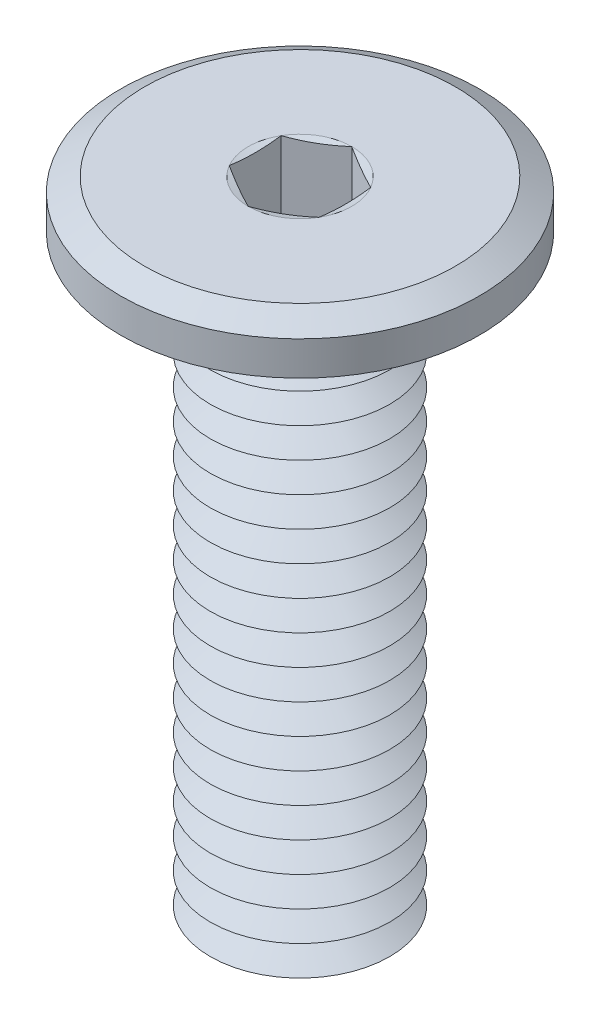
from build123d import *

# Parameters (mm, degrees)
SKETCH1_R           = 3
BOSS_EXTRUDE1_DEPTH = 0.8
SKETCH2_R           = 1.5
BOSS_EXTRUDE2_DEPTH = 10
LPATTERN1_COUNT     = 19
LPATTERN1_PITCH     = 0.5
FILLET1_R           = 0.1
CHAMFER2_SIZE       = 0.4
CHAMFER2_SIZE2      = 0.230940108
CUT_EXTRUDE1_DEPTH  = 1.4


with BuildPart() as part:
    # Sketch1 → Boss-Extrude1 (new body)
    with BuildSketch(Plane(origin=(0, 0, 0), x_dir=(1, 0, 0), z_dir=(0, 1, 0))):
        with Locations(Location((0, 0, 0), (0, 0, 270))):
            Circle(SKETCH1_R)
    extrude(amount=-BOSS_EXTRUDE1_DEPTH)

    # Sketch2 → Boss-Extrude2 (add)
    with BuildSketch(Plane.XZ.offset(0.8)):
        with Locations(Location((0, 0, 0), (0, 0, 270))):
            Circle(SKETCH2_R)
    extrude(amount=BOSS_EXTRUDE2_DEPTH)

    # Sketch5 → Cut-Revolve1 (revolve, cut)
    with BuildSketch(Plane(origin=(0, 0, 0), x_dir=(0, 0, -1), z_dir=(1, 0, 0))):
        Polygon((-1.5, -11.05), (-1.066987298, -10.8), (-1.5, -10.55), align=None)
    cut_revolve1 = revolve(axis=Axis((0, 0.990593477, 0), (0, -1, 0)), mode=Mode.SUBTRACT)

    # LPattern1: Cut-Revolve1 ×19
    with Locations(*[(0, i * LPATTERN1_PITCH, 0) for i in range(1, LPATTERN1_COUNT)]):
        add(cut_revolve1, mode=Mode.SUBTRACT)

    # Fillet1
    fillet1_edges = [part.edges().sort_by_distance(p)[0] for p in [
        (0, -0.8, 1.5),
    ]]
    fillet(fillet1_edges, radius=FILLET1_R)

    # Chamfer2
    chamfer2_edges = [part.edges().sort_by_distance(p)[0] for p in [
        (0, 0, -3),
    ]]
    chamfer2_side = [part.faces().sort_by_distance(p)[0] for p in [
        (0, 0, 0),
    ]]
    chamfer(chamfer2_edges, length=CHAMFER2_SIZE, length2=CHAMFER2_SIZE2, reference=chamfer2_side[0])

    # Sketch6 → Cut-Extrude1 (cut)
    with BuildSketch(Plane(origin=(0, 0, 0), x_dir=(1, 0, 0), z_dir=(0, 1, 0))):
        Polygon((0, 0.866025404), (-0.75, 0.433012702), (-0.75, -0.433012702), (0, -0.866025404), (0.75, -0.433012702), (0.75, 0.433012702), align=None)
    extrude(amount=-CUT_EXTRUDE1_DEPTH, mode=Mode.SUBTRACT)

    # Cut-Extrude2 cone 1 section (on through the dimple's axis) → Cut-Extrude2 (revolve, cut)
    with BuildSketch(Plane(origin=(0, -1.4, 0), x_dir=(0, 0, 1), z_dir=(1, 0, 0))):
        Polygon((0, 0), (0.75, 0), (0, 0.433012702), align=None)
    revolve(axis=Axis((0, -1.4, 0), (0, -1, 0)), mode=Mode.SUBTRACT)

    # Cut-Extrude3 cone 1 section (on through the dimple's axis) → Cut-Extrude3 (revolve, cut)
    with BuildSketch(Plane(origin=(0, 0, 0), x_dir=(0, 0, 1), z_dir=(1, 0, 0))):
        Polygon((0, 0), (0.866025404, 0), (0, 0.232050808), align=None)
    revolve(axis=Axis((0, 0, 0), (0, -1, 0)), mode=Mode.SUBTRACT)


solid = part.part
